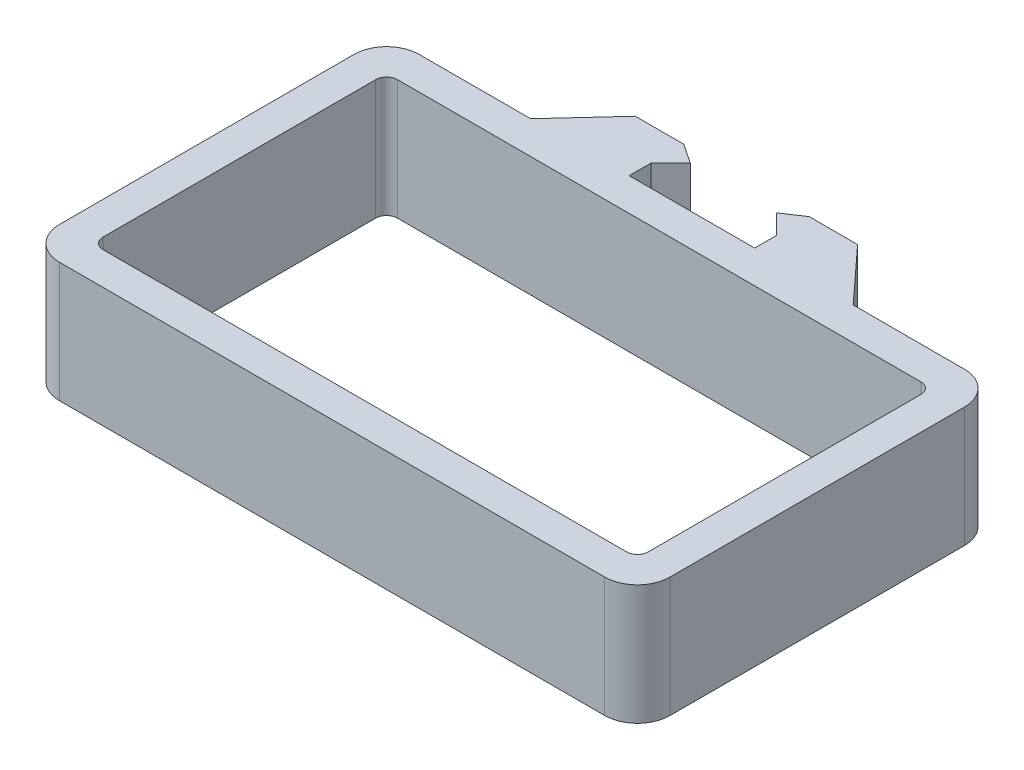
ISO-10303-21;
HEADER;
FILE_DESCRIPTION(('STEP AP214'),'2;1');
FILE_NAME('part.step','',(''),(''),'','','');
FILE_SCHEMA(('AUTOMOTIVE_DESIGN { 1 0 10303 214 1 1 1 1 }'));
ENDSEC;
DATA;
#1=APPLICATION_CONTEXT('core data for automotive mechanical design processes');
#2=APPLICATION_PROTOCOL_DEFINITION('international standard','automotive_design',2000,#1);
#3=PRODUCT_CONTEXT('',#1,'mechanical');
#4=PRODUCT('Part','Part','',(#3));
#5=PRODUCT_RELATED_PRODUCT_CATEGORY('part','',(#4));
#6=PRODUCT_DEFINITION_FORMATION('','',#4);
#7=PRODUCT_DEFINITION_CONTEXT('part definition',#1,'design');
#8=PRODUCT_DEFINITION('design','',#6,#7);
#9=PRODUCT_DEFINITION_SHAPE('','',#8);
#10=(LENGTH_UNIT() NAMED_UNIT(*) SI_UNIT(.MILLI.,.METRE.));
#11=(NAMED_UNIT(*) PLANE_ANGLE_UNIT() SI_UNIT($,.RADIAN.));
#12=(NAMED_UNIT(*) SI_UNIT($,.STERADIAN.) SOLID_ANGLE_UNIT());
#13=UNCERTAINTY_MEASURE_WITH_UNIT(LENGTH_MEASURE(1.E-05),#10,'distance_accuracy_value','');
#14=(GEOMETRIC_REPRESENTATION_CONTEXT(3) GLOBAL_UNCERTAINTY_ASSIGNED_CONTEXT((#13)) GLOBAL_UNIT_ASSIGNED_CONTEXT((#10,
#11,#12)) REPRESENTATION_CONTEXT('',''));
#15=CARTESIAN_POINT('',(0.,0.,0.));
#16=DIRECTION('',(0.,0.,1.));
#17=DIRECTION('',(1.,0.,0.));
#18=AXIS2_PLACEMENT_3D('',#15,#16,#17);
#19=CARTESIAN_POINT('',(0.,11.,-13.5));
#20=DIRECTION('',(0.,0.,-1.));
#21=DIRECTION('',(-1.,0.,0.));
#22=AXIS2_PLACEMENT_3D('',#19,#20,#21);
#23=PLANE('',#22);
#24=DIRECTION('',(1.,0.,0.));
#25=VECTOR('',#24,1.);
#26=CARTESIAN_POINT('',(0.,0.,-13.5));
#27=LINE('',#26,#25);
#28=CARTESIAN_POINT('',(-24.,0.,-13.5));
#29=VERTEX_POINT('',#28);
#30=CARTESIAN_POINT('',(24.,0.,-13.5));
#31=VERTEX_POINT('',#30);
#32=EDGE_CURVE('E311',#29,#31,#27,.T.);
#33=ORIENTED_EDGE('',*,*,#32,.T.);
#34=DIRECTION('',(0.,-1.,0.));
#35=VECTOR('',#34,1.);
#36=CARTESIAN_POINT('',(24.,11.,-13.5));
#37=LINE('',#36,#35);
#38=CARTESIAN_POINT('',(24.,11.,-13.5));
#39=VERTEX_POINT('',#38);
#40=EDGE_CURVE('E11',#39,#31,#37,.T.);
#41=ORIENTED_EDGE('',*,*,#40,.F.);
#42=DIRECTION('',(1.,0.,0.));
#43=VECTOR('',#42,1.);
#44=CARTESIAN_POINT('',(0.,11.,-13.5));
#45=LINE('',#44,#43);
#46=CARTESIAN_POINT('',(-24.,11.,-13.5));
#47=VERTEX_POINT('',#46);
#48=EDGE_CURVE('E443',#47,#39,#45,.T.);
#49=ORIENTED_EDGE('',*,*,#48,.F.);
#50=DIRECTION('',(0.,-1.,0.));
#51=VECTOR('',#50,1.);
#52=CARTESIAN_POINT('',(-24.,11.,-13.5));
#53=LINE('',#52,#51);
#54=EDGE_CURVE('E330',#47,#29,#53,.T.);
#55=ORIENTED_EDGE('',*,*,#54,.T.);
#56=EDGE_LOOP('',(#33,#41,#49,#55));
#57=FACE_BOUND('',#56,.T.);
#58=ADVANCED_FACE('F39',(#57),#23,.F.);
#59=CARTESIAN_POINT('',(24.,11.,-12.5));
#60=DIRECTION('',(0.,-1.,0.));
#61=DIRECTION('',(0.,0.,-1.));
#62=AXIS2_PLACEMENT_3D('',#59,#60,#61);
#63=CYLINDRICAL_SURFACE('',#62,0.999999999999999);
#64=CARTESIAN_POINT('',(24.,0.,-12.5));
#65=DIRECTION('',(0.,1.,0.));
#66=DIRECTION('',(0.,0.,1.));
#67=AXIS2_PLACEMENT_3D('',#64,#65,#66);
#68=CIRCLE('',#67,0.999999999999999);
#69=CARTESIAN_POINT('',(25.,0.,-12.5));
#70=VERTEX_POINT('',#69);
#71=EDGE_CURVE('E314',#31,#70,#68,.F.);
#72=ORIENTED_EDGE('',*,*,#71,.T.);
#73=DIRECTION('',(0.,-1.,0.));
#74=VECTOR('',#73,1.);
#75=CARTESIAN_POINT('',(25.,11.,-12.5));
#76=LINE('',#75,#74);
#77=CARTESIAN_POINT('',(25.,11.,-12.5));
#78=VERTEX_POINT('',#77);
#79=EDGE_CURVE('E49',#78,#70,#76,.T.);
#80=ORIENTED_EDGE('',*,*,#79,.F.);
#81=CARTESIAN_POINT('',(24.,11.,-12.5));
#82=DIRECTION('',(0.,1.,0.));
#83=DIRECTION('',(0.,0.,1.));
#84=AXIS2_PLACEMENT_3D('',#81,#82,#83);
#85=CIRCLE('',#84,0.999999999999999);
#86=EDGE_CURVE('E445',#39,#78,#85,.F.);
#87=ORIENTED_EDGE('',*,*,#86,.F.);
#88=ORIENTED_EDGE('',*,*,#40,.T.);
#89=EDGE_LOOP('',(#72,#80,#87,#88));
#90=FACE_BOUND('',#89,.T.);
#91=ADVANCED_FACE('F475',(#90),#63,.F.);
#92=CARTESIAN_POINT('',(25.,11.,0.));
#93=DIRECTION('',(-1.,0.,0.));
#94=DIRECTION('',(0.,0.,1.));
#95=AXIS2_PLACEMENT_3D('',#92,#93,#94);
#96=PLANE('',#95);
#97=DIRECTION('',(0.,0.,-1.));
#98=VECTOR('',#97,1.);
#99=CARTESIAN_POINT('',(25.,0.,0.));
#100=LINE('',#99,#98);
#101=CARTESIAN_POINT('',(25.,0.,12.5));
#102=VERTEX_POINT('',#101);
#103=EDGE_CURVE('E317',#102,#70,#100,.T.);
#104=ORIENTED_EDGE('',*,*,#103,.F.);
#105=DIRECTION('',(0.,-1.,0.));
#106=VECTOR('',#105,1.);
#107=CARTESIAN_POINT('',(25.,11.,12.5));
#108=LINE('',#107,#106);
#109=CARTESIAN_POINT('',(25.,11.,12.5));
#110=VERTEX_POINT('',#109);
#111=EDGE_CURVE('E336',#110,#102,#108,.T.);
#112=ORIENTED_EDGE('',*,*,#111,.F.);
#113=DIRECTION('',(0.,0.,-1.));
#114=VECTOR('',#113,1.);
#115=CARTESIAN_POINT('',(25.,11.,0.));
#116=LINE('',#115,#114);
#117=EDGE_CURVE('E447',#110,#78,#116,.T.);
#118=ORIENTED_EDGE('',*,*,#117,.T.);
#119=ORIENTED_EDGE('',*,*,#79,.T.);
#120=EDGE_LOOP('',(#104,#112,#118,#119));
#121=FACE_BOUND('',#120,.T.);
#122=ADVANCED_FACE('F480',(#121),#96,.T.);
#123=CARTESIAN_POINT('',(24.,11.,12.5));
#124=DIRECTION('',(0.,-1.,0.));
#125=DIRECTION('',(0.,0.,-1.));
#126=AXIS2_PLACEMENT_3D('',#123,#124,#125);
#127=CYLINDRICAL_SURFACE('',#126,0.999999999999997);
#128=CARTESIAN_POINT('',(24.,0.,12.5));
#129=DIRECTION('',(0.,1.,0.));
#130=DIRECTION('',(0.,0.,1.));
#131=AXIS2_PLACEMENT_3D('',#128,#129,#130);
#132=CIRCLE('',#131,0.999999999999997);
#133=CARTESIAN_POINT('',(24.,0.,13.5));
#134=VERTEX_POINT('',#133);
#135=EDGE_CURVE('E320',#134,#102,#132,.T.);
#136=ORIENTED_EDGE('',*,*,#135,.F.);
#137=DIRECTION('',(0.,-1.,0.));
#138=VECTOR('',#137,1.);
#139=CARTESIAN_POINT('',(24.,11.,13.5));
#140=LINE('',#139,#138);
#141=CARTESIAN_POINT('',(24.,11.,13.5));
#142=VERTEX_POINT('',#141);
#143=EDGE_CURVE('E334',#142,#134,#140,.T.);
#144=ORIENTED_EDGE('',*,*,#143,.F.);
#145=CARTESIAN_POINT('',(24.,11.,12.5));
#146=DIRECTION('',(0.,1.,0.));
#147=DIRECTION('',(0.,0.,1.));
#148=AXIS2_PLACEMENT_3D('',#145,#146,#147);
#149=CIRCLE('',#148,0.999999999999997);
#150=EDGE_CURVE('E450',#142,#110,#149,.T.);
#151=ORIENTED_EDGE('',*,*,#150,.T.);
#152=ORIENTED_EDGE('',*,*,#111,.T.);
#153=EDGE_LOOP('',(#136,#144,#151,#152));
#154=FACE_BOUND('',#153,.T.);
#155=ADVANCED_FACE('F778',(#154),#127,.F.);
#156=CARTESIAN_POINT('',(0.,11.,13.5));
#157=DIRECTION('',(0.,0.,-1.));
#158=DIRECTION('',(-1.,0.,0.));
#159=AXIS2_PLACEMENT_3D('',#156,#157,#158);
#160=PLANE('',#159);
#161=DIRECTION('',(1.,0.,0.));
#162=VECTOR('',#161,1.);
#163=CARTESIAN_POINT('',(0.,0.,13.5));
#164=LINE('',#163,#162);
#165=CARTESIAN_POINT('',(-24.,0.,13.5));
#166=VERTEX_POINT('',#165);
#167=EDGE_CURVE('E323',#166,#134,#164,.T.);
#168=ORIENTED_EDGE('',*,*,#167,.F.);
#169=DIRECTION('',(0.,-1.,0.));
#170=VECTOR('',#169,1.);
#171=CARTESIAN_POINT('',(-24.,11.,13.5));
#172=LINE('',#171,#170);
#173=CARTESIAN_POINT('',(-24.,11.,13.5));
#174=VERTEX_POINT('',#173);
#175=EDGE_CURVE('E250',#174,#166,#172,.T.);
#176=ORIENTED_EDGE('',*,*,#175,.F.);
#177=DIRECTION('',(1.,0.,0.));
#178=VECTOR('',#177,1.);
#179=CARTESIAN_POINT('',(0.,11.,13.5));
#180=LINE('',#179,#178);
#181=EDGE_CURVE('E243',#174,#142,#180,.T.);
#182=ORIENTED_EDGE('',*,*,#181,.T.);
#183=ORIENTED_EDGE('',*,*,#143,.T.);
#184=EDGE_LOOP('',(#168,#176,#182,#183));
#185=FACE_BOUND('',#184,.T.);
#186=ADVANCED_FACE('F454',(#185),#160,.T.);
#187=CARTESIAN_POINT('',(-24.,11.,12.5));
#188=DIRECTION('',(0.,-1.,0.));
#189=DIRECTION('',(0.,0.,-1.));
#190=AXIS2_PLACEMENT_3D('',#187,#188,#189);
#191=CYLINDRICAL_SURFACE('',#190,0.999999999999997);
#192=CARTESIAN_POINT('',(-24.,0.,12.5));
#193=DIRECTION('',(0.,1.,0.));
#194=DIRECTION('',(0.,0.,1.));
#195=AXIS2_PLACEMENT_3D('',#192,#193,#194);
#196=CIRCLE('',#195,0.999999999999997);
#197=CARTESIAN_POINT('',(-25.,0.,12.5));
#198=VERTEX_POINT('',#197);
#199=EDGE_CURVE('E249',#166,#198,#196,.F.);
#200=ORIENTED_EDGE('',*,*,#199,.T.);
#201=DIRECTION('',(0.,-1.,0.));
#202=VECTOR('',#201,1.);
#203=CARTESIAN_POINT('',(-25.,11.,12.5));
#204=LINE('',#203,#202);
#205=CARTESIAN_POINT('',(-25.,11.,12.5));
#206=VERTEX_POINT('',#205);
#207=EDGE_CURVE('E246',#206,#198,#204,.T.);
#208=ORIENTED_EDGE('',*,*,#207,.F.);
#209=CARTESIAN_POINT('',(-24.,11.,12.5));
#210=DIRECTION('',(0.,1.,0.));
#211=DIRECTION('',(0.,0.,1.));
#212=AXIS2_PLACEMENT_3D('',#209,#210,#211);
#213=CIRCLE('',#212,0.999999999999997);
#214=EDGE_CURVE('E236',#174,#206,#213,.F.);
#215=ORIENTED_EDGE('',*,*,#214,.F.);
#216=ORIENTED_EDGE('',*,*,#175,.T.);
#217=EDGE_LOOP('',(#200,#208,#215,#216));
#218=FACE_BOUND('',#217,.T.);
#219=ADVANCED_FACE('F247',(#218),#191,.F.);
#220=CARTESIAN_POINT('',(-25.,11.,0.));
#221=DIRECTION('',(-1.,0.,0.));
#222=DIRECTION('',(0.,0.,1.));
#223=AXIS2_PLACEMENT_3D('',#220,#221,#222);
#224=PLANE('',#223);
#225=DIRECTION('',(0.,0.,-1.));
#226=VECTOR('',#225,1.);
#227=CARTESIAN_POINT('',(-25.,0.,0.));
#228=LINE('',#227,#226);
#229=CARTESIAN_POINT('',(-25.,0.,-12.5));
#230=VERTEX_POINT('',#229);
#231=EDGE_CURVE('E147',#198,#230,#228,.T.);
#232=ORIENTED_EDGE('',*,*,#231,.T.);
#233=DIRECTION('',(0.,-1.,0.));
#234=VECTOR('',#233,1.);
#235=CARTESIAN_POINT('',(-25.,11.,-12.5));
#236=LINE('',#235,#234);
#237=CARTESIAN_POINT('',(-25.,11.,-12.5));
#238=VERTEX_POINT('',#237);
#239=EDGE_CURVE('E251',#238,#230,#236,.T.);
#240=ORIENTED_EDGE('',*,*,#239,.F.);
#241=DIRECTION('',(0.,0.,-1.));
#242=VECTOR('',#241,1.);
#243=CARTESIAN_POINT('',(-25.,11.,0.));
#244=LINE('',#243,#242);
#245=EDGE_CURVE('E240',#206,#238,#244,.T.);
#246=ORIENTED_EDGE('',*,*,#245,.F.);
#247=ORIENTED_EDGE('',*,*,#207,.T.);
#248=EDGE_LOOP('',(#232,#240,#246,#247));
#249=FACE_BOUND('',#248,.T.);
#250=ADVANCED_FACE('F253',(#249),#224,.F.);
#251=CARTESIAN_POINT('',(25.,11.,-13.5));
#252=DIRECTION('',(0.,-1.,0.));
#253=DIRECTION('',(0.,0.,-1.));
#254=AXIS2_PLACEMENT_3D('',#251,#252,#253);
#255=CYLINDRICAL_SURFACE('',#254,3.);
#256=CARTESIAN_POINT('',(25.,0.,-13.5));
#257=DIRECTION('',(0.,1.,0.));
#258=DIRECTION('',(0.,0.,1.));
#259=AXIS2_PLACEMENT_3D('',#256,#257,#258);
#260=CIRCLE('',#259,3.);
#261=CARTESIAN_POINT('',(25.,0.,-16.5));
#262=VERTEX_POINT('',#261);
#263=CARTESIAN_POINT('',(28.,0.,-13.5));
#264=VERTEX_POINT('',#263);
#265=EDGE_CURVE('E259',#262,#264,#260,.F.);
#266=ORIENTED_EDGE('',*,*,#265,.F.);
#267=DIRECTION('',(0.,-1.,0.));
#268=VECTOR('',#267,1.);
#269=CARTESIAN_POINT('',(25.,11.,-16.5));
#270=LINE('',#269,#268);
#271=CARTESIAN_POINT('',(25.,11.,-16.5));
#272=VERTEX_POINT('',#271);
#273=EDGE_CURVE('E43',#272,#262,#270,.T.);
#274=ORIENTED_EDGE('',*,*,#273,.F.);
#275=CARTESIAN_POINT('',(25.,11.,-13.5));
#276=DIRECTION('',(0.,1.,0.));
#277=DIRECTION('',(0.,0.,1.));
#278=AXIS2_PLACEMENT_3D('',#275,#276,#277);
#279=CIRCLE('',#278,3.);
#280=CARTESIAN_POINT('',(28.,11.,-13.5));
#281=VERTEX_POINT('',#280);
#282=EDGE_CURVE('E329',#272,#281,#279,.F.);
#283=ORIENTED_EDGE('',*,*,#282,.T.);
#284=DIRECTION('',(0.,-1.,0.));
#285=VECTOR('',#284,1.);
#286=CARTESIAN_POINT('',(28.,11.,-13.5));
#287=LINE('',#286,#285);
#288=EDGE_CURVE('E255',#281,#264,#287,.T.);
#289=ORIENTED_EDGE('',*,*,#288,.T.);
#290=EDGE_LOOP('',(#266,#274,#283,#289));
#291=FACE_BOUND('',#290,.T.);
#292=ADVANCED_FACE('F41',(#291),#255,.T.);
#293=CARTESIAN_POINT('',(0.,11.,-16.5));
#294=DIRECTION('',(0.,0.,-1.));
#295=DIRECTION('',(-1.,0.,0.));
#296=AXIS2_PLACEMENT_3D('',#293,#294,#295);
#297=PLANE('',#296);
#298=DIRECTION('',(1.,0.,0.));
#299=VECTOR('',#298,1.);
#300=CARTESIAN_POINT('',(0.,0.,-16.5));
#301=LINE('',#300,#299);
#302=CARTESIAN_POINT('',(14.7924732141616,0.,-16.5));
#303=VERTEX_POINT('',#302);
#304=EDGE_CURVE('E262',#303,#262,#301,.T.);
#305=ORIENTED_EDGE('',*,*,#304,.F.);
#306=DIRECTION('',(0.,-1.,0.));
#307=VECTOR('',#306,1.);
#308=CARTESIAN_POINT('',(14.7924732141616,11.,-16.5));
#309=LINE('',#308,#307);
#310=CARTESIAN_POINT('',(14.7924732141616,11.,-16.5));
#311=VERTEX_POINT('',#310);
#312=EDGE_CURVE('E377',#311,#303,#309,.T.);
#313=ORIENTED_EDGE('',*,*,#312,.F.);
#314=DIRECTION('',(1.,0.,0.));
#315=VECTOR('',#314,1.);
#316=CARTESIAN_POINT('',(0.,11.,-16.5));
#317=LINE('',#316,#315);
#318=EDGE_CURVE('E386',#311,#272,#317,.T.);
#319=ORIENTED_EDGE('',*,*,#318,.T.);
#320=ORIENTED_EDGE('',*,*,#273,.T.);
#321=EDGE_LOOP('',(#305,#313,#319,#320));
#322=FACE_BOUND('',#321,.T.);
#323=ADVANCED_FACE('F384',(#322),#297,.T.);
#324=CARTESIAN_POINT('',(16.2309891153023,11.,-14.9368500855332));
#325=DIRECTION('',(0.735832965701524,0.,-0.677163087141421));
#326=DIRECTION('',(-0.677163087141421,0.,-0.735832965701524));
#327=AXIS2_PLACEMENT_3D('',#324,#325,#326);
#328=PLANE('',#327);
#329=DIRECTION('',(0.677163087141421,0.,0.735832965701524));
#330=VECTOR('',#329,1.);
#331=CARTESIAN_POINT('',(16.2309891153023,0.,-14.9368500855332));
#332=LINE('',#331,#330);
#333=CARTESIAN_POINT('',(10.1911362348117,0.,-21.5));
#334=VERTEX_POINT('',#333);
#335=EDGE_CURVE('E265',#334,#303,#332,.T.);
#336=ORIENTED_EDGE('',*,*,#335,.F.);
#337=DIRECTION('',(0.,-1.,0.));
#338=VECTOR('',#337,1.);
#339=CARTESIAN_POINT('',(10.1911362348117,11.,-21.5));
#340=LINE('',#339,#338);
#341=CARTESIAN_POINT('',(10.1911362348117,11.,-21.5));
#342=VERTEX_POINT('',#341);
#343=EDGE_CURVE('E376',#342,#334,#340,.T.);
#344=ORIENTED_EDGE('',*,*,#343,.F.);
#345=DIRECTION('',(0.677163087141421,0.,0.735832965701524));
#346=VECTOR('',#345,1.);
#347=CARTESIAN_POINT('',(16.2309891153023,11.,-14.9368500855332));
#348=LINE('',#347,#346);
#349=EDGE_CURVE('E395',#342,#311,#348,.T.);
#350=ORIENTED_EDGE('',*,*,#349,.T.);
#351=ORIENTED_EDGE('',*,*,#312,.T.);
#352=EDGE_LOOP('',(#336,#344,#350,#351));
#353=FACE_BOUND('',#352,.T.);
#354=ADVANCED_FACE('F393',(#353),#328,.T.);
#355=CARTESIAN_POINT('',(0.,11.,-21.5));
#356=DIRECTION('',(0.,0.,-1.));
#357=DIRECTION('',(-1.,0.,0.));
#358=AXIS2_PLACEMENT_3D('',#355,#356,#357);
#359=PLANE('',#358);
#360=DIRECTION('',(1.,0.,0.));
#361=VECTOR('',#360,1.);
#362=CARTESIAN_POINT('',(0.,0.,-21.5));
#363=LINE('',#362,#361);
#364=CARTESIAN_POINT('',(5.75,0.,-21.5));
#365=VERTEX_POINT('',#364);
#366=EDGE_CURVE('E270',#365,#334,#363,.T.);
#367=ORIENTED_EDGE('',*,*,#366,.F.);
#368=DIRECTION('',(0.,-1.,0.));
#369=VECTOR('',#368,1.);
#370=CARTESIAN_POINT('',(5.75,11.,-21.5));
#371=LINE('',#370,#369);
#372=CARTESIAN_POINT('',(5.75,11.,-21.5));
#373=VERTEX_POINT('',#372);
#374=EDGE_CURVE('E374',#373,#365,#371,.T.);
#375=ORIENTED_EDGE('',*,*,#374,.F.);
#376=DIRECTION('',(1.,0.,0.));
#377=VECTOR('',#376,1.);
#378=CARTESIAN_POINT('',(0.,11.,-21.5));
#379=LINE('',#378,#377);
#380=EDGE_CURVE('E401',#373,#342,#379,.T.);
#381=ORIENTED_EDGE('',*,*,#380,.T.);
#382=ORIENTED_EDGE('',*,*,#343,.T.);
#383=EDGE_LOOP('',(#367,#375,#381,#382));
#384=FACE_BOUND('',#383,.T.);
#385=ADVANCED_FACE('F404',(#384),#359,.T.);
#386=CARTESIAN_POINT('',(-8.15384615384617,11.,-12.2307692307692));
#387=DIRECTION('',(-0.554700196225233,0.,-0.832050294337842));
#388=DIRECTION('',(-0.832050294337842,0.,0.554700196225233));
#389=AXIS2_PLACEMENT_3D('',#386,#387,#388);
#390=PLANE('',#389);
#391=DIRECTION('',(0.832050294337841,0.,-0.554700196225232));
#392=VECTOR('',#391,1.);
#393=CARTESIAN_POINT('',(-8.15384615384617,0.,-12.2307692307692));
#394=LINE('',#393,#392);
#395=CARTESIAN_POINT('',(3.95,0.,-20.3));
#396=VERTEX_POINT('',#395);
#397=EDGE_CURVE('E273',#396,#365,#394,.T.);
#398=ORIENTED_EDGE('',*,*,#397,.F.);
#399=DIRECTION('',(0.,-1.,0.));
#400=VECTOR('',#399,1.);
#401=CARTESIAN_POINT('',(3.95,11.,-20.3));
#402=LINE('',#401,#400);
#403=CARTESIAN_POINT('',(3.95,11.,-20.3));
#404=VERTEX_POINT('',#403);
#405=EDGE_CURVE('E372',#404,#396,#402,.T.);
#406=ORIENTED_EDGE('',*,*,#405,.F.);
#407=DIRECTION('',(0.832050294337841,0.,-0.554700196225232));
#408=VECTOR('',#407,1.);
#409=CARTESIAN_POINT('',(-8.15384615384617,11.,-12.2307692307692));
#410=LINE('',#409,#408);
#411=EDGE_CURVE('E405',#404,#373,#410,.T.);
#412=ORIENTED_EDGE('',*,*,#411,.T.);
#413=ORIENTED_EDGE('',*,*,#374,.T.);
#414=EDGE_LOOP('',(#398,#406,#412,#413));
#415=FACE_BOUND('',#414,.T.);
#416=ADVANCED_FACE('F536',(#415),#390,.T.);
#417=CARTESIAN_POINT('',(12.125,11.,-12.1250000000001));
#418=DIRECTION('',(-0.707106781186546,0.,0.707106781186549));
#419=DIRECTION('',(0.707106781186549,0.,0.707106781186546));
#420=AXIS2_PLACEMENT_3D('',#417,#418,#419);
#421=PLANE('',#420);
#422=DIRECTION('',(-0.70710678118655,0.,-0.707106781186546));
#423=VECTOR('',#422,1.);
#424=CARTESIAN_POINT('',(12.125,0.,-12.1250000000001));
#425=LINE('',#424,#423);
#426=CARTESIAN_POINT('',(5.75,0.,-18.5));
#427=VERTEX_POINT('',#426);
#428=EDGE_CURVE('E276',#427,#396,#425,.T.);
#429=ORIENTED_EDGE('',*,*,#428,.F.);
#430=DIRECTION('',(0.,-1.,0.));
#431=VECTOR('',#430,1.);
#432=CARTESIAN_POINT('',(5.75,11.,-18.5));
#433=LINE('',#432,#431);
#434=CARTESIAN_POINT('',(5.75,11.,-18.5));
#435=VERTEX_POINT('',#434);
#436=EDGE_CURVE('E370',#435,#427,#433,.T.);
#437=ORIENTED_EDGE('',*,*,#436,.F.);
#438=DIRECTION('',(-0.70710678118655,0.,-0.707106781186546));
#439=VECTOR('',#438,1.);
#440=CARTESIAN_POINT('',(12.125,11.,-12.1250000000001));
#441=LINE('',#440,#439);
#442=EDGE_CURVE('E407',#435,#404,#441,.T.);
#443=ORIENTED_EDGE('',*,*,#442,.T.);
#444=ORIENTED_EDGE('',*,*,#405,.T.);
#445=EDGE_LOOP('',(#429,#437,#443,#444));
#446=FACE_BOUND('',#445,.T.);
#447=ADVANCED_FACE('F532',(#446),#421,.T.);
#448=CARTESIAN_POINT('',(5.74999999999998,11.,0.));
#449=DIRECTION('',(-1.,0.,0.));
#450=DIRECTION('',(0.,0.,1.));
#451=AXIS2_PLACEMENT_3D('',#448,#449,#450);
#452=PLANE('',#451);
#453=DIRECTION('',(0.,0.,-1.));
#454=VECTOR('',#453,1.);
#455=CARTESIAN_POINT('',(5.74999999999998,0.,0.));
#456=LINE('',#455,#454);
#457=CARTESIAN_POINT('',(5.75,0.,-16.5));
#458=VERTEX_POINT('',#457);
#459=EDGE_CURVE('E279',#458,#427,#456,.T.);
#460=ORIENTED_EDGE('',*,*,#459,.F.);
#461=DIRECTION('',(0.,-1.,0.));
#462=VECTOR('',#461,1.);
#463=CARTESIAN_POINT('',(5.75,11.,-16.5));
#464=LINE('',#463,#462);
#465=CARTESIAN_POINT('',(5.75,11.,-16.5));
#466=VERTEX_POINT('',#465);
#467=EDGE_CURVE('E368',#466,#458,#464,.T.);
#468=ORIENTED_EDGE('',*,*,#467,.F.);
#469=DIRECTION('',(0.,0.,-1.));
#470=VECTOR('',#469,1.);
#471=CARTESIAN_POINT('',(5.74999999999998,11.,0.));
#472=LINE('',#471,#470);
#473=EDGE_CURVE('E413',#466,#435,#472,.T.);
#474=ORIENTED_EDGE('',*,*,#473,.T.);
#475=ORIENTED_EDGE('',*,*,#436,.T.);
#476=EDGE_LOOP('',(#460,#468,#474,#475));
#477=FACE_BOUND('',#476,.T.);
#478=ADVANCED_FACE('F529',(#477),#452,.T.);
#479=CARTESIAN_POINT('',(-5.75,0.,-16.5));
#480=VERTEX_POINT('',#479);
#481=EDGE_CURVE('E267',#480,#458,#301,.T.);
#482=ORIENTED_EDGE('',*,*,#481,.F.);
#483=DIRECTION('',(0.,-1.,0.));
#484=VECTOR('',#483,1.);
#485=CARTESIAN_POINT('',(-5.75,11.,-16.5));
#486=LINE('',#485,#484);
#487=CARTESIAN_POINT('',(-5.75,11.,-16.5));
#488=VERTEX_POINT('',#487);
#489=EDGE_CURVE('E366',#488,#480,#486,.T.);
#490=ORIENTED_EDGE('',*,*,#489,.F.);
#491=EDGE_CURVE('E416',#488,#466,#317,.T.);
#492=ORIENTED_EDGE('',*,*,#491,.T.);
#493=ORIENTED_EDGE('',*,*,#467,.T.);
#494=EDGE_LOOP('',(#482,#490,#492,#493));
#495=FACE_BOUND('',#494,.T.);
#496=ADVANCED_FACE('F509',(#495),#297,.T.);
#497=CARTESIAN_POINT('',(-5.74999999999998,11.,0.));
#498=DIRECTION('',(-1.,0.,0.));
#499=DIRECTION('',(0.,0.,1.));
#500=AXIS2_PLACEMENT_3D('',#497,#498,#499);
#501=PLANE('',#500);
#502=DIRECTION('',(0.,0.,-1.));
#503=VECTOR('',#502,1.);
#504=CARTESIAN_POINT('',(-5.74999999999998,0.,0.));
#505=LINE('',#504,#503);
#506=CARTESIAN_POINT('',(-5.75,0.,-18.5));
#507=VERTEX_POINT('',#506);
#508=EDGE_CURVE('E282',#480,#507,#505,.T.);
#509=ORIENTED_EDGE('',*,*,#508,.T.);
#510=DIRECTION('',(0.,-1.,0.));
#511=VECTOR('',#510,1.);
#512=CARTESIAN_POINT('',(-5.75,11.,-18.5));
#513=LINE('',#512,#511);
#514=CARTESIAN_POINT('',(-5.75,11.,-18.5));
#515=VERTEX_POINT('',#514);
#516=EDGE_CURVE('E363',#515,#507,#513,.T.);
#517=ORIENTED_EDGE('',*,*,#516,.F.);
#518=DIRECTION('',(0.,0.,-1.));
#519=VECTOR('',#518,1.);
#520=CARTESIAN_POINT('',(-5.74999999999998,11.,0.));
#521=LINE('',#520,#519);
#522=EDGE_CURVE('E417',#488,#515,#521,.T.);
#523=ORIENTED_EDGE('',*,*,#522,.F.);
#524=ORIENTED_EDGE('',*,*,#489,.T.);
#525=EDGE_LOOP('',(#509,#517,#523,#524));
#526=FACE_BOUND('',#525,.T.);
#527=ADVANCED_FACE('F524',(#526),#501,.F.);
#528=CARTESIAN_POINT('',(-12.125,11.,-12.1250000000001));
#529=DIRECTION('',(-0.707106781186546,0.,-0.707106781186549));
#530=DIRECTION('',(-0.707106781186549,0.,0.707106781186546));
#531=AXIS2_PLACEMENT_3D('',#528,#529,#530);
#532=PLANE('',#531);
#533=DIRECTION('',(0.70710678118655,0.,-0.707106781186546));
#534=VECTOR('',#533,1.);
#535=CARTESIAN_POINT('',(-12.125,0.,-12.1250000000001));
#536=LINE('',#535,#534);
#537=CARTESIAN_POINT('',(-3.95,0.,-20.3));
#538=VERTEX_POINT('',#537);
#539=EDGE_CURVE('E284',#507,#538,#536,.T.);
#540=ORIENTED_EDGE('',*,*,#539,.T.);
#541=DIRECTION('',(0.,-1.,0.));
#542=VECTOR('',#541,1.);
#543=CARTESIAN_POINT('',(-3.95,11.,-20.3));
#544=LINE('',#543,#542);
#545=CARTESIAN_POINT('',(-3.95,11.,-20.3));
#546=VERTEX_POINT('',#545);
#547=EDGE_CURVE('E360',#546,#538,#544,.T.);
#548=ORIENTED_EDGE('',*,*,#547,.F.);
#549=DIRECTION('',(0.70710678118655,0.,-0.707106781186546));
#550=VECTOR('',#549,1.);
#551=CARTESIAN_POINT('',(-12.125,11.,-12.1250000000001));
#552=LINE('',#551,#550);
#553=EDGE_CURVE('E419',#515,#546,#552,.T.);
#554=ORIENTED_EDGE('',*,*,#553,.F.);
#555=ORIENTED_EDGE('',*,*,#516,.T.);
#556=EDGE_LOOP('',(#540,#548,#554,#555));
#557=FACE_BOUND('',#556,.T.);
#558=ADVANCED_FACE('F520',(#557),#532,.F.);
#559=CARTESIAN_POINT('',(8.15384615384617,11.,-12.2307692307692));
#560=DIRECTION('',(-0.554700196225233,0.,0.832050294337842));
#561=DIRECTION('',(0.832050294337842,0.,0.554700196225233));
#562=AXIS2_PLACEMENT_3D('',#559,#560,#561);
#563=PLANE('',#562);
#564=DIRECTION('',(-0.832050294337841,0.,-0.554700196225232));
#565=VECTOR('',#564,1.);
#566=CARTESIAN_POINT('',(8.15384615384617,0.,-12.2307692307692));
#567=LINE('',#566,#565);
#568=CARTESIAN_POINT('',(-5.75,0.,-21.5));
#569=VERTEX_POINT('',#568);
#570=EDGE_CURVE('E286',#538,#569,#567,.T.);
#571=ORIENTED_EDGE('',*,*,#570,.T.);
#572=DIRECTION('',(0.,-1.,0.));
#573=VECTOR('',#572,1.);
#574=CARTESIAN_POINT('',(-5.75,11.,-21.5));
#575=LINE('',#574,#573);
#576=CARTESIAN_POINT('',(-5.75,11.,-21.5));
#577=VERTEX_POINT('',#576);
#578=EDGE_CURVE('E357',#577,#569,#575,.T.);
#579=ORIENTED_EDGE('',*,*,#578,.F.);
#580=DIRECTION('',(-0.832050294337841,0.,-0.554700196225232));
#581=VECTOR('',#580,1.);
#582=CARTESIAN_POINT('',(8.15384615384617,11.,-12.2307692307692));
#583=LINE('',#582,#581);
#584=EDGE_CURVE('E421',#546,#577,#583,.T.);
#585=ORIENTED_EDGE('',*,*,#584,.F.);
#586=ORIENTED_EDGE('',*,*,#547,.T.);
#587=EDGE_LOOP('',(#571,#579,#585,#586));
#588=FACE_BOUND('',#587,.T.);
#589=ADVANCED_FACE('F516',(#588),#563,.F.);
#590=CARTESIAN_POINT('',(0.,11.,-21.5));
#591=DIRECTION('',(0.,0.,1.));
#592=DIRECTION('',(1.,0.,0.));
#593=AXIS2_PLACEMENT_3D('',#590,#591,#592);
#594=PLANE('',#593);
#595=DIRECTION('',(-1.,0.,0.));
#596=VECTOR('',#595,1.);
#597=CARTESIAN_POINT('',(0.,0.,-21.5));
#598=LINE('',#597,#596);
#599=CARTESIAN_POINT('',(-10.1911362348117,0.,-21.5));
#600=VERTEX_POINT('',#599);
#601=EDGE_CURVE('E288',#569,#600,#598,.T.);
#602=ORIENTED_EDGE('',*,*,#601,.T.);
#603=DIRECTION('',(0.,-1.,0.));
#604=VECTOR('',#603,1.);
#605=CARTESIAN_POINT('',(-10.1911362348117,11.,-21.5));
#606=LINE('',#605,#604);
#607=CARTESIAN_POINT('',(-10.1911362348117,11.,-21.5));
#608=VERTEX_POINT('',#607);
#609=EDGE_CURVE('E354',#608,#600,#606,.T.);
#610=ORIENTED_EDGE('',*,*,#609,.F.);
#611=DIRECTION('',(-1.,0.,0.));
#612=VECTOR('',#611,1.);
#613=CARTESIAN_POINT('',(0.,11.,-21.5));
#614=LINE('',#613,#612);
#615=EDGE_CURVE('E423',#577,#608,#614,.T.);
#616=ORIENTED_EDGE('',*,*,#615,.F.);
#617=ORIENTED_EDGE('',*,*,#578,.T.);
#618=EDGE_LOOP('',(#602,#610,#616,#617));
#619=FACE_BOUND('',#618,.T.);
#620=ADVANCED_FACE('F512',(#619),#594,.F.);
#621=CARTESIAN_POINT('',(-16.2309891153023,11.,-14.9368500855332));
#622=DIRECTION('',(0.735832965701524,0.,0.677163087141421));
#623=DIRECTION('',(0.677163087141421,0.,-0.735832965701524));
#624=AXIS2_PLACEMENT_3D('',#621,#622,#623);
#625=PLANE('',#624);
#626=DIRECTION('',(-0.677163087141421,0.,0.735832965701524));
#627=VECTOR('',#626,1.);
#628=CARTESIAN_POINT('',(-16.2309891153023,0.,-14.9368500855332));
#629=LINE('',#628,#627);
#630=CARTESIAN_POINT('',(-14.7924732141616,0.,-16.5));
#631=VERTEX_POINT('',#630);
#632=EDGE_CURVE('E290',#600,#631,#629,.T.);
#633=ORIENTED_EDGE('',*,*,#632,.T.);
#634=DIRECTION('',(0.,-1.,0.));
#635=VECTOR('',#634,1.);
#636=CARTESIAN_POINT('',(-14.7924732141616,11.,-16.5));
#637=LINE('',#636,#635);
#638=CARTESIAN_POINT('',(-14.7924732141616,11.,-16.5));
#639=VERTEX_POINT('',#638);
#640=EDGE_CURVE('E352',#639,#631,#637,.T.);
#641=ORIENTED_EDGE('',*,*,#640,.F.);
#642=DIRECTION('',(-0.677163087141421,0.,0.735832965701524));
#643=VECTOR('',#642,1.);
#644=CARTESIAN_POINT('',(-16.2309891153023,11.,-14.9368500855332));
#645=LINE('',#644,#643);
#646=EDGE_CURVE('E425',#608,#639,#645,.T.);
#647=ORIENTED_EDGE('',*,*,#646,.F.);
#648=ORIENTED_EDGE('',*,*,#609,.T.);
#649=EDGE_LOOP('',(#633,#641,#647,#648));
#650=FACE_BOUND('',#649,.T.);
#651=ADVANCED_FACE('F507',(#650),#625,.F.);
#652=CARTESIAN_POINT('',(-25.,0.,-16.5));
#653=VERTEX_POINT('',#652);
#654=EDGE_CURVE('E266',#653,#631,#301,.T.);
#655=ORIENTED_EDGE('',*,*,#654,.F.);
#656=DIRECTION('',(0.,-1.,0.));
#657=VECTOR('',#656,1.);
#658=CARTESIAN_POINT('',(-25.,11.,-16.5));
#659=LINE('',#658,#657);
#660=CARTESIAN_POINT('',(-25.,11.,-16.5));
#661=VERTEX_POINT('',#660);
#662=EDGE_CURVE('E350',#661,#653,#659,.T.);
#663=ORIENTED_EDGE('',*,*,#662,.F.);
#664=EDGE_CURVE('E427',#661,#639,#317,.T.);
#665=ORIENTED_EDGE('',*,*,#664,.T.);
#666=ORIENTED_EDGE('',*,*,#640,.T.);
#667=EDGE_LOOP('',(#655,#663,#665,#666));
#668=FACE_BOUND('',#667,.T.);
#669=ADVANCED_FACE('F503',(#668),#297,.T.);
#670=CARTESIAN_POINT('',(-25.,11.,-13.5));
#671=DIRECTION('',(0.,-1.,0.));
#672=DIRECTION('',(0.,0.,-1.));
#673=AXIS2_PLACEMENT_3D('',#670,#671,#672);
#674=CYLINDRICAL_SURFACE('',#673,3.);
#675=CARTESIAN_POINT('',(-25.,0.,-13.5));
#676=DIRECTION('',(0.,1.,0.));
#677=DIRECTION('',(0.,0.,1.));
#678=AXIS2_PLACEMENT_3D('',#675,#676,#677);
#679=CIRCLE('',#678,3.);
#680=CARTESIAN_POINT('',(-28.,0.,-13.5));
#681=VERTEX_POINT('',#680);
#682=EDGE_CURVE('E293',#653,#681,#679,.T.);
#683=ORIENTED_EDGE('',*,*,#682,.T.);
#684=DIRECTION('',(0.,-1.,0.));
#685=VECTOR('',#684,1.);
#686=CARTESIAN_POINT('',(-28.,11.,-13.5));
#687=LINE('',#686,#685);
#688=CARTESIAN_POINT('',(-28.,11.,-13.5));
#689=VERTEX_POINT('',#688);
#690=EDGE_CURVE('E348',#689,#681,#687,.T.);
#691=ORIENTED_EDGE('',*,*,#690,.F.);
#692=CARTESIAN_POINT('',(-25.,11.,-13.5));
#693=DIRECTION('',(0.,1.,0.));
#694=DIRECTION('',(0.,0.,1.));
#695=AXIS2_PLACEMENT_3D('',#692,#693,#694);
#696=CIRCLE('',#695,3.);
#697=EDGE_CURVE('E428',#661,#689,#696,.T.);
#698=ORIENTED_EDGE('',*,*,#697,.F.);
#699=ORIENTED_EDGE('',*,*,#662,.T.);
#700=EDGE_LOOP('',(#683,#691,#698,#699));
#701=FACE_BOUND('',#700,.T.);
#702=ADVANCED_FACE('F499',(#701),#674,.T.);
#703=CARTESIAN_POINT('',(-28.,11.,0.));
#704=DIRECTION('',(-1.,0.,0.));
#705=DIRECTION('',(0.,0.,1.));
#706=AXIS2_PLACEMENT_3D('',#703,#704,#705);
#707=PLANE('',#706);
#708=DIRECTION('',(0.,0.,-1.));
#709=VECTOR('',#708,1.);
#710=CARTESIAN_POINT('',(-28.,0.,0.));
#711=LINE('',#710,#709);
#712=CARTESIAN_POINT('',(-28.,0.,13.5));
#713=VERTEX_POINT('',#712);
#714=EDGE_CURVE('E296',#713,#681,#711,.T.);
#715=ORIENTED_EDGE('',*,*,#714,.F.);
#716=DIRECTION('',(0.,-1.,0.));
#717=VECTOR('',#716,1.);
#718=CARTESIAN_POINT('',(-28.,11.,13.5));
#719=LINE('',#718,#717);
#720=CARTESIAN_POINT('',(-28.,11.,13.5));
#721=VERTEX_POINT('',#720);
#722=EDGE_CURVE('E346',#721,#713,#719,.T.);
#723=ORIENTED_EDGE('',*,*,#722,.F.);
#724=DIRECTION('',(0.,0.,-1.));
#725=VECTOR('',#724,1.);
#726=CARTESIAN_POINT('',(-28.,11.,0.));
#727=LINE('',#726,#725);
#728=EDGE_CURVE('E430',#721,#689,#727,.T.);
#729=ORIENTED_EDGE('',*,*,#728,.T.);
#730=ORIENTED_EDGE('',*,*,#690,.T.);
#731=EDGE_LOOP('',(#715,#723,#729,#730));
#732=FACE_BOUND('',#731,.T.);
#733=ADVANCED_FACE('F495',(#732),#707,.T.);
#734=CARTESIAN_POINT('',(-25.,11.,13.5));
#735=DIRECTION('',(0.,-1.,0.));
#736=DIRECTION('',(0.,0.,-1.));
#737=AXIS2_PLACEMENT_3D('',#734,#735,#736);
#738=CYLINDRICAL_SURFACE('',#737,3.);
#739=CARTESIAN_POINT('',(-25.,0.,13.5));
#740=DIRECTION('',(0.,1.,0.));
#741=DIRECTION('',(0.,0.,1.));
#742=AXIS2_PLACEMENT_3D('',#739,#740,#741);
#743=CIRCLE('',#742,3.);
#744=CARTESIAN_POINT('',(-25.,0.,16.5));
#745=VERTEX_POINT('',#744);
#746=EDGE_CURVE('E299',#745,#713,#743,.F.);
#747=ORIENTED_EDGE('',*,*,#746,.F.);
#748=DIRECTION('',(0.,-1.,0.));
#749=VECTOR('',#748,1.);
#750=CARTESIAN_POINT('',(-25.,11.,16.5));
#751=LINE('',#750,#749);
#752=CARTESIAN_POINT('',(-25.,11.,16.5));
#753=VERTEX_POINT('',#752);
#754=EDGE_CURVE('E344',#753,#745,#751,.T.);
#755=ORIENTED_EDGE('',*,*,#754,.F.);
#756=CARTESIAN_POINT('',(-25.,11.,13.5));
#757=DIRECTION('',(0.,1.,0.));
#758=DIRECTION('',(0.,0.,1.));
#759=AXIS2_PLACEMENT_3D('',#756,#757,#758);
#760=CIRCLE('',#759,3.);
#761=EDGE_CURVE('E433',#753,#721,#760,.F.);
#762=ORIENTED_EDGE('',*,*,#761,.T.);
#763=ORIENTED_EDGE('',*,*,#722,.T.);
#764=EDGE_LOOP('',(#747,#755,#762,#763));
#765=FACE_BOUND('',#764,.T.);
#766=ADVANCED_FACE('F491',(#765),#738,.T.);
#767=CARTESIAN_POINT('',(0.,11.,16.5));
#768=DIRECTION('',(0.,0.,-1.));
#769=DIRECTION('',(-1.,0.,0.));
#770=AXIS2_PLACEMENT_3D('',#767,#768,#769);
#771=PLANE('',#770);
#772=DIRECTION('',(1.,0.,0.));
#773=VECTOR('',#772,1.);
#774=CARTESIAN_POINT('',(0.,0.,16.5));
#775=LINE('',#774,#773);
#776=CARTESIAN_POINT('',(25.,0.,16.5));
#777=VERTEX_POINT('',#776);
#778=EDGE_CURVE('E302',#745,#777,#775,.T.);
#779=ORIENTED_EDGE('',*,*,#778,.T.);
#780=DIRECTION('',(0.,-1.,0.));
#781=VECTOR('',#780,1.);
#782=CARTESIAN_POINT('',(25.,11.,16.5));
#783=LINE('',#782,#781);
#784=CARTESIAN_POINT('',(25.,11.,16.5));
#785=VERTEX_POINT('',#784);
#786=EDGE_CURVE('E342',#785,#777,#783,.T.);
#787=ORIENTED_EDGE('',*,*,#786,.F.);
#788=DIRECTION('',(1.,0.,0.));
#789=VECTOR('',#788,1.);
#790=CARTESIAN_POINT('',(0.,11.,16.5));
#791=LINE('',#790,#789);
#792=EDGE_CURVE('E436',#753,#785,#791,.T.);
#793=ORIENTED_EDGE('',*,*,#792,.F.);
#794=ORIENTED_EDGE('',*,*,#754,.T.);
#795=EDGE_LOOP('',(#779,#787,#793,#794));
#796=FACE_BOUND('',#795,.T.);
#797=ADVANCED_FACE('F487',(#796),#771,.F.);
#798=CARTESIAN_POINT('',(25.,11.,13.5));
#799=DIRECTION('',(0.,-1.,0.));
#800=DIRECTION('',(0.,0.,-1.));
#801=AXIS2_PLACEMENT_3D('',#798,#799,#800);
#802=CYLINDRICAL_SURFACE('',#801,3.);
#803=CARTESIAN_POINT('',(25.,0.,13.5));
#804=DIRECTION('',(0.,1.,0.));
#805=DIRECTION('',(0.,0.,1.));
#806=AXIS2_PLACEMENT_3D('',#803,#804,#805);
#807=CIRCLE('',#806,3.);
#808=CARTESIAN_POINT('',(28.,0.,13.5));
#809=VERTEX_POINT('',#808);
#810=EDGE_CURVE('E305',#809,#777,#807,.F.);
#811=ORIENTED_EDGE('',*,*,#810,.F.);
#812=DIRECTION('',(0.,-1.,0.));
#813=VECTOR('',#812,1.);
#814=CARTESIAN_POINT('',(28.,11.,13.5));
#815=LINE('',#814,#813);
#816=CARTESIAN_POINT('',(28.,11.,13.5));
#817=VERTEX_POINT('',#816);
#818=EDGE_CURVE('E340',#817,#809,#815,.T.);
#819=ORIENTED_EDGE('',*,*,#818,.F.);
#820=CARTESIAN_POINT('',(25.,11.,13.5));
#821=DIRECTION('',(0.,1.,0.));
#822=DIRECTION('',(0.,0.,1.));
#823=AXIS2_PLACEMENT_3D('',#820,#821,#822);
#824=CIRCLE('',#823,3.);
#825=EDGE_CURVE('E438',#817,#785,#824,.F.);
#826=ORIENTED_EDGE('',*,*,#825,.T.);
#827=ORIENTED_EDGE('',*,*,#786,.T.);
#828=EDGE_LOOP('',(#811,#819,#826,#827));
#829=FACE_BOUND('',#828,.T.);
#830=ADVANCED_FACE('F469',(#829),#802,.T.);
#831=CARTESIAN_POINT('',(28.,11.,0.));
#832=DIRECTION('',(-1.,0.,0.));
#833=DIRECTION('',(0.,0.,1.));
#834=AXIS2_PLACEMENT_3D('',#831,#832,#833);
#835=PLANE('',#834);
#836=DIRECTION('',(0.,0.,-1.));
#837=VECTOR('',#836,1.);
#838=CARTESIAN_POINT('',(28.,0.,0.));
#839=LINE('',#838,#837);
#840=EDGE_CURVE('E308',#809,#264,#839,.T.);
#841=ORIENTED_EDGE('',*,*,#840,.T.);
#842=ORIENTED_EDGE('',*,*,#288,.F.);
#843=DIRECTION('',(0.,0.,-1.));
#844=VECTOR('',#843,1.);
#845=CARTESIAN_POINT('',(28.,11.,0.));
#846=LINE('',#845,#844);
#847=EDGE_CURVE('E441',#817,#281,#846,.T.);
#848=ORIENTED_EDGE('',*,*,#847,.F.);
#849=ORIENTED_EDGE('',*,*,#818,.T.);
#850=EDGE_LOOP('',(#841,#842,#848,#849));
#851=FACE_BOUND('',#850,.T.);
#852=ADVANCED_FACE('F462',(#851),#835,.F.);
#853=CARTESIAN_POINT('',(-24.,11.,-12.5));
#854=DIRECTION('',(0.,-1.,0.));
#855=DIRECTION('',(0.,0.,-1.));
#856=AXIS2_PLACEMENT_3D('',#853,#854,#855);
#857=CYLINDRICAL_SURFACE('',#856,0.999999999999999);
#858=CARTESIAN_POINT('',(-24.,0.,-12.5));
#859=DIRECTION('',(0.,1.,0.));
#860=DIRECTION('',(0.,0.,1.));
#861=AXIS2_PLACEMENT_3D('',#858,#859,#860);
#862=CIRCLE('',#861,0.999999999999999);
#863=EDGE_CURVE('E153',#230,#29,#862,.F.);
#864=ORIENTED_EDGE('',*,*,#863,.T.);
#865=ORIENTED_EDGE('',*,*,#54,.F.);
#866=CARTESIAN_POINT('',(-24.,11.,-12.5));
#867=DIRECTION('',(0.,1.,0.));
#868=DIRECTION('',(0.,0.,1.));
#869=AXIS2_PLACEMENT_3D('',#866,#867,#868);
#870=CIRCLE('',#869,0.999999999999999);
#871=EDGE_CURVE('E58',#238,#47,#870,.F.);
#872=ORIENTED_EDGE('',*,*,#871,.F.);
#873=ORIENTED_EDGE('',*,*,#239,.T.);
#874=EDGE_LOOP('',(#864,#865,#872,#873));
#875=FACE_BOUND('',#874,.T.);
#876=ADVANCED_FACE('F460',(#875),#857,.F.);
#877=CARTESIAN_POINT('',(0.,11.,0.));
#878=DIRECTION('',(0.,1.,0.));
#879=DIRECTION('',(0.,0.,1.));
#880=AXIS2_PLACEMENT_3D('',#877,#878,#879);
#881=PLANE('',#880);
#882=ORIENTED_EDGE('',*,*,#282,.F.);
#883=ORIENTED_EDGE('',*,*,#318,.F.);
#884=ORIENTED_EDGE('',*,*,#349,.F.);
#885=ORIENTED_EDGE('',*,*,#380,.F.);
#886=ORIENTED_EDGE('',*,*,#411,.F.);
#887=ORIENTED_EDGE('',*,*,#442,.F.);
#888=ORIENTED_EDGE('',*,*,#473,.F.);
#889=ORIENTED_EDGE('',*,*,#491,.F.);
#890=ORIENTED_EDGE('',*,*,#522,.T.);
#891=ORIENTED_EDGE('',*,*,#553,.T.);
#892=ORIENTED_EDGE('',*,*,#584,.T.);
#893=ORIENTED_EDGE('',*,*,#615,.T.);
#894=ORIENTED_EDGE('',*,*,#646,.T.);
#895=ORIENTED_EDGE('',*,*,#664,.F.);
#896=ORIENTED_EDGE('',*,*,#697,.T.);
#897=ORIENTED_EDGE('',*,*,#728,.F.);
#898=ORIENTED_EDGE('',*,*,#761,.F.);
#899=ORIENTED_EDGE('',*,*,#792,.T.);
#900=ORIENTED_EDGE('',*,*,#825,.F.);
#901=ORIENTED_EDGE('',*,*,#847,.T.);
#902=EDGE_LOOP('',(#882,#883,#884,#885,#886,#887,#888,#889,#890,#891,#892,#893,#894,#895,#896,
#897,#898,#899,#900,#901));
#903=FACE_BOUND('',#902,.T.);
#904=ORIENTED_EDGE('',*,*,#48,.T.);
#905=ORIENTED_EDGE('',*,*,#86,.T.);
#906=ORIENTED_EDGE('',*,*,#117,.F.);
#907=ORIENTED_EDGE('',*,*,#150,.F.);
#908=ORIENTED_EDGE('',*,*,#181,.F.);
#909=ORIENTED_EDGE('',*,*,#214,.T.);
#910=ORIENTED_EDGE('',*,*,#245,.T.);
#911=ORIENTED_EDGE('',*,*,#871,.T.);
#912=EDGE_LOOP('',(#904,#905,#906,#907,#908,#909,#910,#911));
#913=FACE_BOUND('',#912,.T.);
#914=ADVANCED_FACE('F238',(#903,#913),#881,.T.);
#915=CARTESIAN_POINT('',(0.,0.,0.));
#916=DIRECTION('',(0.,1.,0.));
#917=DIRECTION('',(0.,0.,1.));
#918=AXIS2_PLACEMENT_3D('',#915,#916,#917);
#919=PLANE('',#918);
#920=ORIENTED_EDGE('',*,*,#265,.T.);
#921=ORIENTED_EDGE('',*,*,#840,.F.);
#922=ORIENTED_EDGE('',*,*,#810,.T.);
#923=ORIENTED_EDGE('',*,*,#778,.F.);
#924=ORIENTED_EDGE('',*,*,#746,.T.);
#925=ORIENTED_EDGE('',*,*,#714,.T.);
#926=ORIENTED_EDGE('',*,*,#682,.F.);
#927=ORIENTED_EDGE('',*,*,#654,.T.);
#928=ORIENTED_EDGE('',*,*,#632,.F.);
#929=ORIENTED_EDGE('',*,*,#601,.F.);
#930=ORIENTED_EDGE('',*,*,#570,.F.);
#931=ORIENTED_EDGE('',*,*,#539,.F.);
#932=ORIENTED_EDGE('',*,*,#508,.F.);
#933=ORIENTED_EDGE('',*,*,#481,.T.);
#934=ORIENTED_EDGE('',*,*,#459,.T.);
#935=ORIENTED_EDGE('',*,*,#428,.T.);
#936=ORIENTED_EDGE('',*,*,#397,.T.);
#937=ORIENTED_EDGE('',*,*,#366,.T.);
#938=ORIENTED_EDGE('',*,*,#335,.T.);
#939=ORIENTED_EDGE('',*,*,#304,.T.);
#940=EDGE_LOOP('',(#920,#921,#922,#923,#924,#925,#926,#927,#928,#929,#930,#931,#932,#933,#934,
#935,#936,#937,#938,#939));
#941=FACE_BOUND('',#940,.T.);
#942=ORIENTED_EDGE('',*,*,#32,.F.);
#943=ORIENTED_EDGE('',*,*,#863,.F.);
#944=ORIENTED_EDGE('',*,*,#231,.F.);
#945=ORIENTED_EDGE('',*,*,#199,.F.);
#946=ORIENTED_EDGE('',*,*,#167,.T.);
#947=ORIENTED_EDGE('',*,*,#135,.T.);
#948=ORIENTED_EDGE('',*,*,#103,.T.);
#949=ORIENTED_EDGE('',*,*,#71,.F.);
#950=EDGE_LOOP('',(#942,#943,#944,#945,#946,#947,#948,#949));
#951=FACE_BOUND('',#950,.T.);
#952=ADVANCED_FACE('F390',(#941,#951),#919,.F.);
#953=CLOSED_SHELL('',(#58,#91,#122,#155,#186,#219,#250,#292,#323,#354,#385,#416,#447,#478,#496,
#527,#558,#589,#620,#651,#669,#702,#733,#766,#797,#830,#852,#876,#914,#952));
#954=MANIFOLD_SOLID_BREP('B2',#953);
#955=ADVANCED_BREP_SHAPE_REPRESENTATION('',(#18,#954),#14);
#956=SHAPE_DEFINITION_REPRESENTATION(#9,#955);
ENDSEC;
END-ISO-10303-21;
